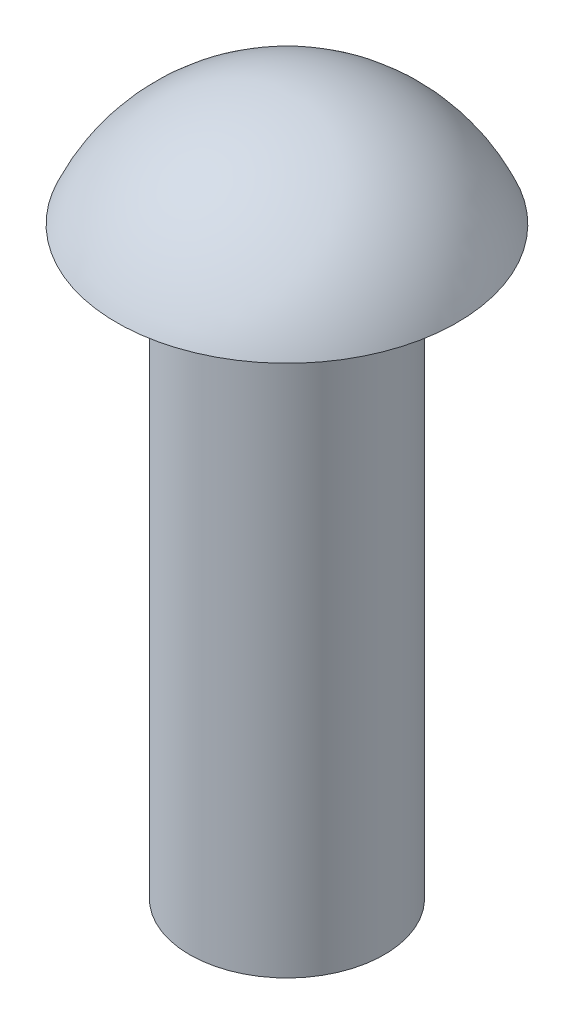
ISO-10303-21;
HEADER;
FILE_DESCRIPTION(('STEP AP214'),'2;1');
FILE_NAME('part.step','',(''),(''),'','','');
FILE_SCHEMA(('AUTOMOTIVE_DESIGN { 1 0 10303 214 1 1 1 1 }'));
ENDSEC;
DATA;
#1=APPLICATION_CONTEXT('core data for automotive mechanical design processes');
#2=APPLICATION_PROTOCOL_DEFINITION('international standard','automotive_design',2000,#1);
#3=PRODUCT_CONTEXT('',#1,'mechanical');
#4=PRODUCT('Part','Part','',(#3));
#5=PRODUCT_RELATED_PRODUCT_CATEGORY('part','',(#4));
#6=PRODUCT_DEFINITION_FORMATION('','',#4);
#7=PRODUCT_DEFINITION_CONTEXT('part definition',#1,'design');
#8=PRODUCT_DEFINITION('design','',#6,#7);
#9=PRODUCT_DEFINITION_SHAPE('','',#8);
#10=(LENGTH_UNIT() NAMED_UNIT(*) SI_UNIT(.MILLI.,.METRE.));
#11=(NAMED_UNIT(*) PLANE_ANGLE_UNIT() SI_UNIT($,.RADIAN.));
#12=(NAMED_UNIT(*) SI_UNIT($,.STERADIAN.) SOLID_ANGLE_UNIT());
#13=UNCERTAINTY_MEASURE_WITH_UNIT(LENGTH_MEASURE(1.E-05),#10,'distance_accuracy_value','');
#14=(GEOMETRIC_REPRESENTATION_CONTEXT(3) GLOBAL_UNCERTAINTY_ASSIGNED_CONTEXT((#13)) GLOBAL_UNIT_ASSIGNED_CONTEXT((#10,
#11,#12)) REPRESENTATION_CONTEXT('',''));
#15=CARTESIAN_POINT('',(0.,0.,0.));
#16=DIRECTION('',(0.,0.,1.));
#17=DIRECTION('',(1.,0.,0.));
#18=AXIS2_PLACEMENT_3D('',#15,#16,#17);
#19=CARTESIAN_POINT('',(0.,0.,0.));
#20=DIRECTION('',(0.,-1.,0.));
#21=DIRECTION('',(0.,0.,-1.));
#22=AXIS2_PLACEMENT_3D('',#19,#20,#21);
#23=PLANE('',#22);
#24=CARTESIAN_POINT('',(0.,0.,0.));
#25=DIRECTION('',(0.,-1.,0.));
#26=DIRECTION('',(0.,0.,-1.));
#27=AXIS2_PLACEMENT_3D('',#24,#25,#26);
#28=CIRCLE('',#27,3.5);
#29=CARTESIAN_POINT('',(0.,0.,-3.5));
#30=VERTEX_POINT('',#29);
#31=EDGE_CURVE('E10',#30,#30,#28,.T.);
#32=ORIENTED_EDGE('',*,*,#31,.T.);
#33=EDGE_LOOP('',(#32));
#34=FACE_BOUND('',#33,.T.);
#35=CARTESIAN_POINT('',(0.,0.,0.));
#36=DIRECTION('',(0.,-1.,0.));
#37=DIRECTION('',(0.,0.,-1.));
#38=AXIS2_PLACEMENT_3D('',#35,#36,#37);
#39=CIRCLE('',#38,2.);
#40=CARTESIAN_POINT('',(0.,0.,-2.));
#41=VERTEX_POINT('',#40);
#42=EDGE_CURVE('E34',#41,#41,#39,.T.);
#43=ORIENTED_EDGE('',*,*,#42,.F.);
#44=EDGE_LOOP('',(#43));
#45=FACE_BOUND('',#44,.T.);
#46=ADVANCED_FACE('F24',(#34,#45),#23,.T.);
#47=CARTESIAN_POINT('',(0.,-1.47986485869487,0.));
#48=DIRECTION('',(0.,-1.,0.));
#49=DIRECTION('',(0.,0.,-1.));
#50=AXIS2_PLACEMENT_3D('',#47,#48,#49);
#51=SPHERICAL_SURFACE('',#50,3.8);
#52=ORIENTED_EDGE('',*,*,#31,.F.);
#53=EDGE_LOOP('',(#52));
#54=FACE_BOUND('',#53,.T.);
#55=ADVANCED_FACE('F44',(#54),#51,.T.);
#56=CARTESIAN_POINT('',(0.,-12.,0.));
#57=DIRECTION('',(0.,1.,0.));
#58=DIRECTION('',(0.,0.,1.));
#59=AXIS2_PLACEMENT_3D('',#56,#57,#58);
#60=CYLINDRICAL_SURFACE('',#59,2.);
#61=CARTESIAN_POINT('',(0.,-12.,0.));
#62=DIRECTION('',(0.,-1.,0.));
#63=DIRECTION('',(0.,0.,-1.));
#64=AXIS2_PLACEMENT_3D('',#61,#62,#63);
#65=CIRCLE('',#64,2.);
#66=CARTESIAN_POINT('',(0.,-12.,-2.));
#67=VERTEX_POINT('',#66);
#68=EDGE_CURVE('E30',#67,#67,#65,.T.);
#69=ORIENTED_EDGE('',*,*,#68,.F.);
#70=EDGE_LOOP('',(#69));
#71=FACE_BOUND('',#70,.T.);
#72=ORIENTED_EDGE('',*,*,#42,.T.);
#73=EDGE_LOOP('',(#72));
#74=FACE_BOUND('',#73,.T.);
#75=ADVANCED_FACE('F41',(#71,#74),#60,.T.);
#76=CARTESIAN_POINT('',(0.,-12.,0.));
#77=DIRECTION('',(0.,-1.,0.));
#78=DIRECTION('',(0.,0.,-1.));
#79=AXIS2_PLACEMENT_3D('',#76,#77,#78);
#80=PLANE('',#79);
#81=ORIENTED_EDGE('',*,*,#68,.T.);
#82=EDGE_LOOP('',(#81));
#83=FACE_BOUND('',#82,.T.);
#84=ADVANCED_FACE('F52',(#83),#80,.T.);
#85=CLOSED_SHELL('',(#46,#55,#75,#84));
#86=MANIFOLD_SOLID_BREP('B2',#85);
#87=ADVANCED_BREP_SHAPE_REPRESENTATION('',(#18,#86),#14);
#88=SHAPE_DEFINITION_REPRESENTATION(#9,#87);
ENDSEC;
END-ISO-10303-21;
